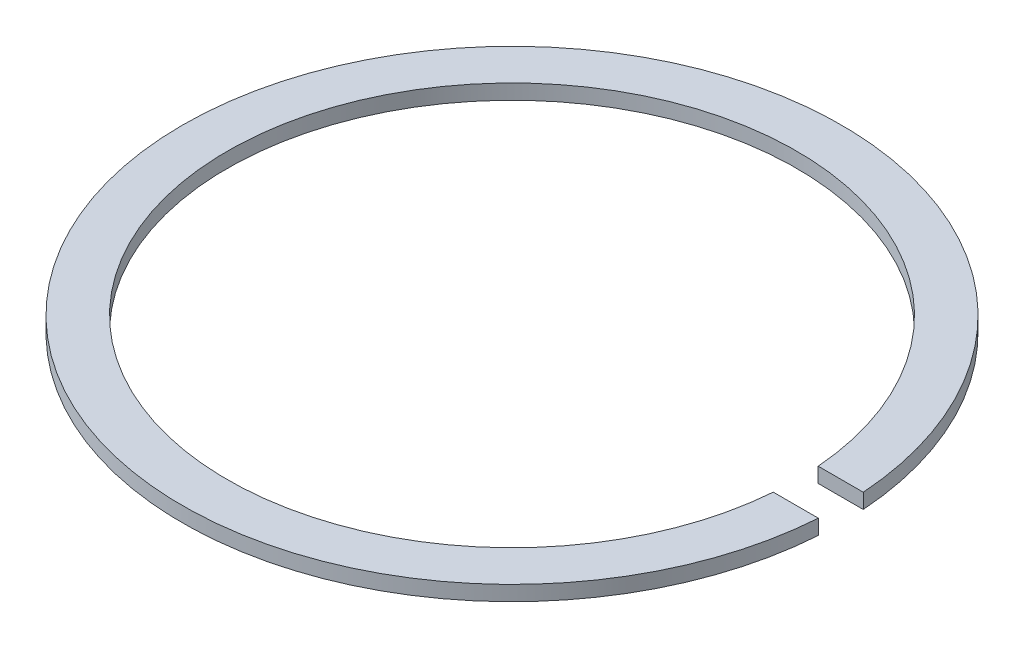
from build123d import *

# Parameters (mm, degrees)
ESQUISSE1_W             = 3
ESQUISSE1_H             = 1
ESQUISSE2_W             = 22
ESQUISSE2_H             = 3
ENL_V_MAT_EXTRU_3_DEPTH = 32.128764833


with BuildPart() as part:
    # Esquisse1 → cylindre (revolve)
    with BuildSketch(Plane.XY, mode=Mode.PRIVATE) as cylindre_sk:
        with Locations((20.5, 3.5)):
            Rectangle(ESQUISSE1_W, ESQUISSE1_H)
    revolve(cylindre_sk.sketch.rotate(Axis((0, -3, 0), (0, 1, 0)), 90), axis=Axis((0, -3, 0), (0, 1, 0)))

    # Esquisse2 → Enl_v. mat.-Extru.3 (cut, through all)
    with BuildSketch(Plane.XZ.offset(-3)):
        with Locations((11, 0)):
            Rectangle(ESQUISSE2_W, ESQUISSE2_H)
    extrude(amount=-ENL_V_MAT_EXTRU_3_DEPTH, mode=Mode.SUBTRACT)


solid = part.part
